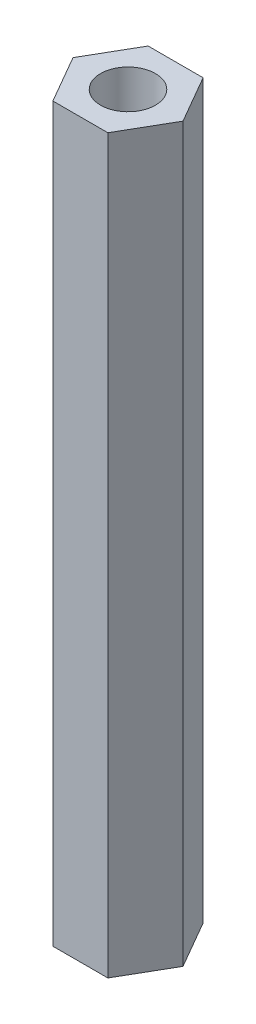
ISO-10303-21;
HEADER;
FILE_DESCRIPTION(('STEP AP214'),'2;1');
FILE_NAME('part.step','',(''),(''),'','','');
FILE_SCHEMA(('AUTOMOTIVE_DESIGN { 1 0 10303 214 1 1 1 1 }'));
ENDSEC;
DATA;
#1=APPLICATION_CONTEXT('core data for automotive mechanical design processes');
#2=APPLICATION_PROTOCOL_DEFINITION('international standard','automotive_design',2000,#1);
#3=PRODUCT_CONTEXT('',#1,'mechanical');
#4=PRODUCT('Part','Part','',(#3));
#5=PRODUCT_RELATED_PRODUCT_CATEGORY('part','',(#4));
#6=PRODUCT_DEFINITION_FORMATION('','',#4);
#7=PRODUCT_DEFINITION_CONTEXT('part definition',#1,'design');
#8=PRODUCT_DEFINITION('design','',#6,#7);
#9=PRODUCT_DEFINITION_SHAPE('','',#8);
#10=(LENGTH_UNIT() NAMED_UNIT(*) SI_UNIT(.MILLI.,.METRE.));
#11=(NAMED_UNIT(*) PLANE_ANGLE_UNIT() SI_UNIT($,.RADIAN.));
#12=(NAMED_UNIT(*) SI_UNIT($,.STERADIAN.) SOLID_ANGLE_UNIT());
#13=UNCERTAINTY_MEASURE_WITH_UNIT(LENGTH_MEASURE(1.E-05),#10,'distance_accuracy_value','');
#14=(GEOMETRIC_REPRESENTATION_CONTEXT(3) GLOBAL_UNCERTAINTY_ASSIGNED_CONTEXT((#13)) GLOBAL_UNIT_ASSIGNED_CONTEXT((#10,
#11,#12)) REPRESENTATION_CONTEXT('',''));
#15=CARTESIAN_POINT('',(0.,0.,0.));
#16=DIRECTION('',(0.,0.,1.));
#17=DIRECTION('',(1.,0.,0.));
#18=AXIS2_PLACEMENT_3D('',#15,#16,#17);
#19=CARTESIAN_POINT('',(0.,40.,0.));
#20=DIRECTION('',(0.,1.,0.));
#21=DIRECTION('',(0.,0.,1.));
#22=AXIS2_PLACEMENT_3D('',#19,#20,#21);
#23=PLANE('',#22);
#24=DIRECTION('',(0.499999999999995,0.,-0.866025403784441));
#25=VECTOR('',#24,1.);
#26=CARTESIAN_POINT('',(1.50244361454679,40.,2.60230867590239));
#27=LINE('',#26,#25);
#28=CARTESIAN_POINT('',(1.50244361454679,40.,2.60230867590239));
#29=VERTEX_POINT('',#28);
#30=CARTESIAN_POINT('',(3.00488722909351,40.,0.));
#31=VERTEX_POINT('',#30);
#32=EDGE_CURVE('E150',#29,#31,#27,.T.);
#33=ORIENTED_EDGE('',*,*,#32,.T.);
#34=DIRECTION('',(-0.500000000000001,0.,-0.866025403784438));
#35=VECTOR('',#34,1.);
#36=CARTESIAN_POINT('',(3.00488722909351,40.,0.));
#37=LINE('',#36,#35);
#38=CARTESIAN_POINT('',(1.50244361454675,40.,-2.60230867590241));
#39=VERTEX_POINT('',#38);
#40=EDGE_CURVE('E98',#31,#39,#37,.T.);
#41=ORIENTED_EDGE('',*,*,#40,.T.);
#42=DIRECTION('',(-1.,0.,0.));
#43=VECTOR('',#42,1.);
#44=CARTESIAN_POINT('',(1.50244361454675,40.,-2.60230867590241));
#45=LINE('',#44,#43);
#46=CARTESIAN_POINT('',(-1.50244361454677,40.,-2.6023086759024));
#47=VERTEX_POINT('',#46);
#48=EDGE_CURVE('E111',#39,#47,#45,.T.);
#49=ORIENTED_EDGE('',*,*,#48,.T.);
#50=DIRECTION('',(-0.499999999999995,0.,0.866025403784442));
#51=VECTOR('',#50,1.);
#52=CARTESIAN_POINT('',(-1.50244361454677,40.,-2.6023086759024));
#53=LINE('',#52,#51);
#54=CARTESIAN_POINT('',(-3.00488722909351,40.,0.));
#55=VERTEX_POINT('',#54);
#56=EDGE_CURVE('E105',#47,#55,#53,.T.);
#57=ORIENTED_EDGE('',*,*,#56,.T.);
#58=DIRECTION('',(0.500000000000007,0.,0.866025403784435));
#59=VECTOR('',#58,1.);
#60=CARTESIAN_POINT('',(-3.00488722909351,40.,0.));
#61=LINE('',#60,#59);
#62=CARTESIAN_POINT('',(-1.50244361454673,40.,2.60230867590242));
#63=VERTEX_POINT('',#62);
#64=EDGE_CURVE('E109',#55,#63,#61,.T.);
#65=ORIENTED_EDGE('',*,*,#64,.T.);
#66=DIRECTION('',(1.,0.,0.));
#67=VECTOR('',#66,1.);
#68=CARTESIAN_POINT('',(-1.50244361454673,40.,2.60230867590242));
#69=LINE('',#68,#67);
#70=EDGE_CURVE('E61',#63,#29,#69,.T.);
#71=ORIENTED_EDGE('',*,*,#70,.T.);
#72=EDGE_LOOP('',(#33,#41,#49,#57,#65,#71));
#73=FACE_BOUND('',#72,.T.);
#74=CARTESIAN_POINT('',(0.,40.,0.));
#75=DIRECTION('',(0.,1.,0.));
#76=DIRECTION('',(0.,0.,1.));
#77=AXIS2_PLACEMENT_3D('',#74,#75,#76);
#78=CIRCLE('',#77,1.5);
#79=CARTESIAN_POINT('',(0.,40.,1.5));
#80=VERTEX_POINT('',#79);
#81=EDGE_CURVE('E138',#80,#80,#78,.T.);
#82=ORIENTED_EDGE('',*,*,#81,.F.);
#83=EDGE_LOOP('',(#82));
#84=FACE_BOUND('',#83,.T.);
#85=ADVANCED_FACE('F43',(#73,#84),#23,.T.);
#86=CARTESIAN_POINT('',(0.,0.,0.));
#87=DIRECTION('',(0.,1.,0.));
#88=DIRECTION('',(0.,0.,1.));
#89=AXIS2_PLACEMENT_3D('',#86,#87,#88);
#90=PLANE('',#89);
#91=DIRECTION('',(0.499999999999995,0.,-0.866025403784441));
#92=VECTOR('',#91,1.);
#93=CARTESIAN_POINT('',(1.50244361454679,0.,2.60230867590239));
#94=LINE('',#93,#92);
#95=CARTESIAN_POINT('',(1.50244361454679,0.,2.60230867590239));
#96=VERTEX_POINT('',#95);
#97=CARTESIAN_POINT('',(3.00488722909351,0.,0.));
#98=VERTEX_POINT('',#97);
#99=EDGE_CURVE('E133',#96,#98,#94,.T.);
#100=ORIENTED_EDGE('',*,*,#99,.F.);
#101=DIRECTION('',(1.,0.,0.));
#102=VECTOR('',#101,1.);
#103=CARTESIAN_POINT('',(-1.50244361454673,0.,2.60230867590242));
#104=LINE('',#103,#102);
#105=CARTESIAN_POINT('',(-1.50244361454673,0.,2.60230867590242));
#106=VERTEX_POINT('',#105);
#107=EDGE_CURVE('E90',#106,#96,#104,.T.);
#108=ORIENTED_EDGE('',*,*,#107,.F.);
#109=DIRECTION('',(0.500000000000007,0.,0.866025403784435));
#110=VECTOR('',#109,1.);
#111=CARTESIAN_POINT('',(-3.00488722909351,0.,0.));
#112=LINE('',#111,#110);
#113=CARTESIAN_POINT('',(-3.00488722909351,0.,0.));
#114=VERTEX_POINT('',#113);
#115=EDGE_CURVE('E84',#114,#106,#112,.T.);
#116=ORIENTED_EDGE('',*,*,#115,.F.);
#117=DIRECTION('',(-0.499999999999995,0.,0.866025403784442));
#118=VECTOR('',#117,1.);
#119=CARTESIAN_POINT('',(-1.50244361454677,0.,-2.6023086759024));
#120=LINE('',#119,#118);
#121=CARTESIAN_POINT('',(-1.50244361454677,0.,-2.6023086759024));
#122=VERTEX_POINT('',#121);
#123=EDGE_CURVE('E120',#122,#114,#120,.T.);
#124=ORIENTED_EDGE('',*,*,#123,.F.);
#125=DIRECTION('',(-1.,0.,0.));
#126=VECTOR('',#125,1.);
#127=CARTESIAN_POINT('',(1.50244361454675,0.,-2.60230867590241));
#128=LINE('',#127,#126);
#129=CARTESIAN_POINT('',(1.50244361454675,0.,-2.60230867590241));
#130=VERTEX_POINT('',#129);
#131=EDGE_CURVE('E141',#130,#122,#128,.T.);
#132=ORIENTED_EDGE('',*,*,#131,.F.);
#133=DIRECTION('',(-0.500000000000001,0.,-0.866025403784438));
#134=VECTOR('',#133,1.);
#135=CARTESIAN_POINT('',(3.00488722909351,0.,0.));
#136=LINE('',#135,#134);
#137=EDGE_CURVE('E137',#98,#130,#136,.T.);
#138=ORIENTED_EDGE('',*,*,#137,.F.);
#139=EDGE_LOOP('',(#100,#108,#116,#124,#132,#138));
#140=FACE_BOUND('',#139,.T.);
#141=CARTESIAN_POINT('',(0.,0.,0.));
#142=DIRECTION('',(0.,1.,0.));
#143=DIRECTION('',(0.,0.,1.));
#144=AXIS2_PLACEMENT_3D('',#141,#142,#143);
#145=CIRCLE('',#144,1.5);
#146=CARTESIAN_POINT('',(0.,0.,1.5));
#147=VERTEX_POINT('',#146);
#148=EDGE_CURVE('E265',#147,#147,#145,.T.);
#149=ORIENTED_EDGE('',*,*,#148,.T.);
#150=EDGE_LOOP('',(#149));
#151=FACE_BOUND('',#150,.T.);
#152=ADVANCED_FACE('F163',(#140,#151),#90,.F.);
#153=CARTESIAN_POINT('',(1.50244361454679,40.,2.60230867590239));
#154=DIRECTION('',(-0.866025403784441,0.,-0.499999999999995));
#155=DIRECTION('',(-0.499999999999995,0.,0.866025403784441));
#156=AXIS2_PLACEMENT_3D('',#153,#154,#155);
#157=PLANE('',#156);
#158=ORIENTED_EDGE('',*,*,#99,.T.);
#159=DIRECTION('',(0.,-1.,0.));
#160=VECTOR('',#159,1.);
#161=CARTESIAN_POINT('',(3.00488722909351,40.,0.));
#162=LINE('',#161,#160);
#163=EDGE_CURVE('E11',#31,#98,#162,.T.);
#164=ORIENTED_EDGE('',*,*,#163,.F.);
#165=ORIENTED_EDGE('',*,*,#32,.F.);
#166=DIRECTION('',(0.,-1.,0.));
#167=VECTOR('',#166,1.);
#168=CARTESIAN_POINT('',(1.50244361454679,40.,2.60230867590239));
#169=LINE('',#168,#167);
#170=EDGE_CURVE('E129',#29,#96,#169,.T.);
#171=ORIENTED_EDGE('',*,*,#170,.T.);
#172=EDGE_LOOP('',(#158,#164,#165,#171));
#173=FACE_BOUND('',#172,.T.);
#174=ADVANCED_FACE('F45',(#173),#157,.F.);
#175=CARTESIAN_POINT('',(3.00488722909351,40.,0.));
#176=DIRECTION('',(-0.866025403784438,0.,0.500000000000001));
#177=DIRECTION('',(0.500000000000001,0.,0.866025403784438));
#178=AXIS2_PLACEMENT_3D('',#175,#176,#177);
#179=PLANE('',#178);
#180=ORIENTED_EDGE('',*,*,#137,.T.);
#181=DIRECTION('',(0.,-1.,0.));
#182=VECTOR('',#181,1.);
#183=CARTESIAN_POINT('',(1.50244361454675,40.,-2.60230867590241));
#184=LINE('',#183,#182);
#185=EDGE_CURVE('E53',#39,#130,#184,.T.);
#186=ORIENTED_EDGE('',*,*,#185,.F.);
#187=ORIENTED_EDGE('',*,*,#40,.F.);
#188=ORIENTED_EDGE('',*,*,#163,.T.);
#189=EDGE_LOOP('',(#180,#186,#187,#188));
#190=FACE_BOUND('',#189,.T.);
#191=ADVANCED_FACE('F188',(#190),#179,.F.);
#192=CARTESIAN_POINT('',(1.50244361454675,40.,-2.60230867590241));
#193=DIRECTION('',(0.,0.,1.));
#194=DIRECTION('',(1.,0.,0.));
#195=AXIS2_PLACEMENT_3D('',#192,#193,#194);
#196=PLANE('',#195);
#197=ORIENTED_EDGE('',*,*,#131,.T.);
#198=DIRECTION('',(0.,-1.,0.));
#199=VECTOR('',#198,1.);
#200=CARTESIAN_POINT('',(-1.50244361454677,40.,-2.6023086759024));
#201=LINE('',#200,#199);
#202=EDGE_CURVE('E122',#47,#122,#201,.T.);
#203=ORIENTED_EDGE('',*,*,#202,.F.);
#204=ORIENTED_EDGE('',*,*,#48,.F.);
#205=ORIENTED_EDGE('',*,*,#185,.T.);
#206=EDGE_LOOP('',(#197,#203,#204,#205));
#207=FACE_BOUND('',#206,.T.);
#208=ADVANCED_FACE('F160',(#207),#196,.F.);
#209=CARTESIAN_POINT('',(-1.50244361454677,40.,-2.6023086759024));
#210=DIRECTION('',(0.866025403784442,0.,0.499999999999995));
#211=DIRECTION('',(0.499999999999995,0.,-0.866025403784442));
#212=AXIS2_PLACEMENT_3D('',#209,#210,#211);
#213=PLANE('',#212);
#214=ORIENTED_EDGE('',*,*,#123,.T.);
#215=DIRECTION('',(0.,-1.,0.));
#216=VECTOR('',#215,1.);
#217=CARTESIAN_POINT('',(-3.00488722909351,40.,0.));
#218=LINE('',#217,#216);
#219=EDGE_CURVE('E117',#55,#114,#218,.T.);
#220=ORIENTED_EDGE('',*,*,#219,.F.);
#221=ORIENTED_EDGE('',*,*,#56,.F.);
#222=ORIENTED_EDGE('',*,*,#202,.T.);
#223=EDGE_LOOP('',(#214,#220,#221,#222));
#224=FACE_BOUND('',#223,.T.);
#225=ADVANCED_FACE('F118',(#224),#213,.F.);
#226=CARTESIAN_POINT('',(-3.00488722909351,40.,0.));
#227=DIRECTION('',(0.866025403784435,0.,-0.500000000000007));
#228=DIRECTION('',(-0.500000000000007,0.,-0.866025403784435));
#229=AXIS2_PLACEMENT_3D('',#226,#227,#228);
#230=PLANE('',#229);
#231=ORIENTED_EDGE('',*,*,#115,.T.);
#232=DIRECTION('',(0.,-1.,0.));
#233=VECTOR('',#232,1.);
#234=CARTESIAN_POINT('',(-1.50244361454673,40.,2.60230867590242));
#235=LINE('',#234,#233);
#236=EDGE_CURVE('E123',#63,#106,#235,.T.);
#237=ORIENTED_EDGE('',*,*,#236,.F.);
#238=ORIENTED_EDGE('',*,*,#64,.F.);
#239=ORIENTED_EDGE('',*,*,#219,.T.);
#240=EDGE_LOOP('',(#231,#237,#238,#239));
#241=FACE_BOUND('',#240,.T.);
#242=ADVANCED_FACE('F125',(#241),#230,.F.);
#243=CARTESIAN_POINT('',(-1.50244361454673,40.,2.60230867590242));
#244=DIRECTION('',(0.,0.,-1.));
#245=DIRECTION('',(-1.,0.,0.));
#246=AXIS2_PLACEMENT_3D('',#243,#244,#245);
#247=PLANE('',#246);
#248=ORIENTED_EDGE('',*,*,#107,.T.);
#249=ORIENTED_EDGE('',*,*,#170,.F.);
#250=ORIENTED_EDGE('',*,*,#70,.F.);
#251=ORIENTED_EDGE('',*,*,#236,.T.);
#252=EDGE_LOOP('',(#248,#249,#250,#251));
#253=FACE_BOUND('',#252,.T.);
#254=ADVANCED_FACE('F168',(#253),#247,.F.);
#255=CARTESIAN_POINT('',(0.,40.,0.));
#256=DIRECTION('',(0.,-1.,0.));
#257=DIRECTION('',(0.,0.,-1.));
#258=AXIS2_PLACEMENT_3D('',#255,#256,#257);
#259=CYLINDRICAL_SURFACE('',#258,1.5);
#260=ORIENTED_EDGE('',*,*,#81,.T.);
#261=EDGE_LOOP('',(#260));
#262=FACE_BOUND('',#261,.T.);
#263=ORIENTED_EDGE('',*,*,#148,.F.);
#264=EDGE_LOOP('',(#263));
#265=FACE_BOUND('',#264,.T.);
#266=ADVANCED_FACE('F170',(#262,#265),#259,.F.);
#267=CLOSED_SHELL('',(#85,#152,#174,#191,#208,#225,#242,#254,#266));
#268=MANIFOLD_SOLID_BREP('B2',#267);
#269=ADVANCED_BREP_SHAPE_REPRESENTATION('',(#18,#268),#14);
#270=SHAPE_DEFINITION_REPRESENTATION(#9,#269);
ENDSEC;
END-ISO-10303-21;
